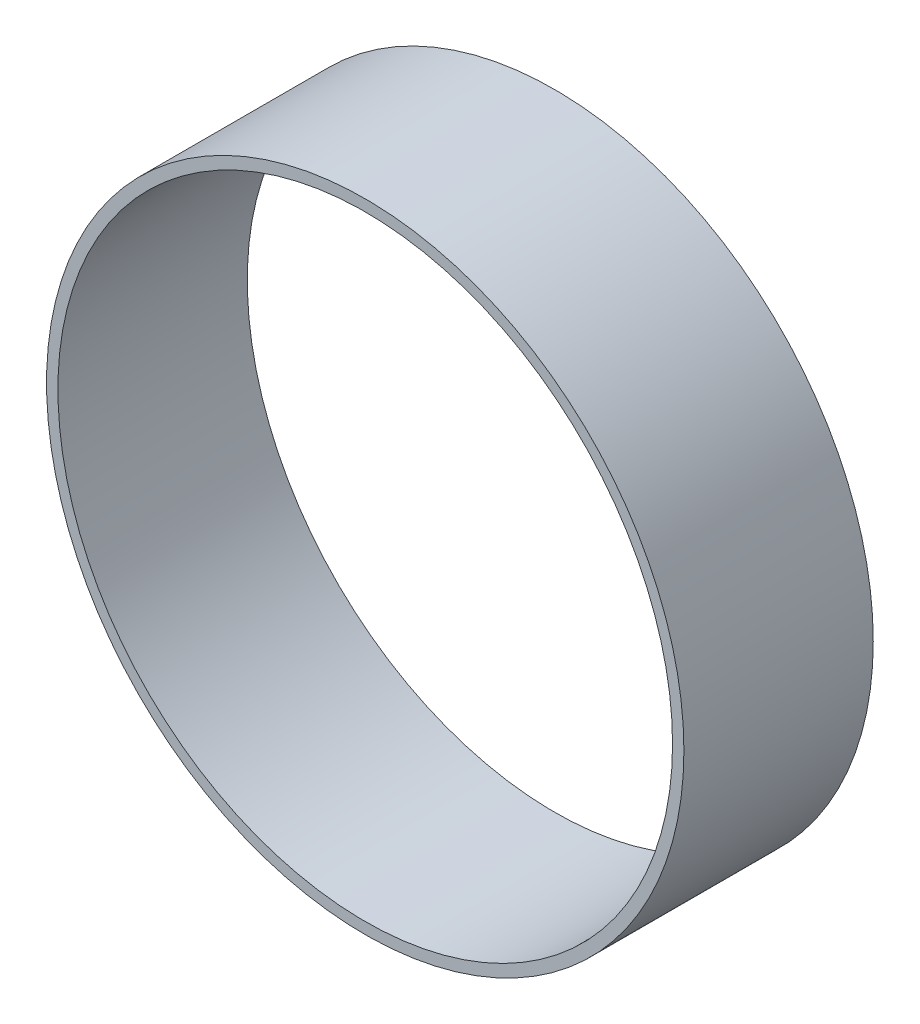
from build123d import *

# Parameters (mm, degrees)
ESQUISSE_DE_TUYAU_R   = 84.15
ESQUISSE_DE_TUYAU_R_2 = 81.15


with BuildPart() as part:
    # Balayage mince: sweep along a path in Esquisse de filtre
    with BuildLine(Plane(origin=(0, 0, 0), x_dir=(1, 0, 0), z_dir=(0, 1, 0))) as balayage_mince_path:
        Line((0, 0), (0, 50))
    # Esquisse de tuyau → Balayage mince (sweep)
    with BuildSketch(Plane.XY):
        Circle(ESQUISSE_DE_TUYAU_R)
        Circle(ESQUISSE_DE_TUYAU_R_2, mode=Mode.SUBTRACT)
    sweep(path=balayage_mince_path.line)


solid = part.part
